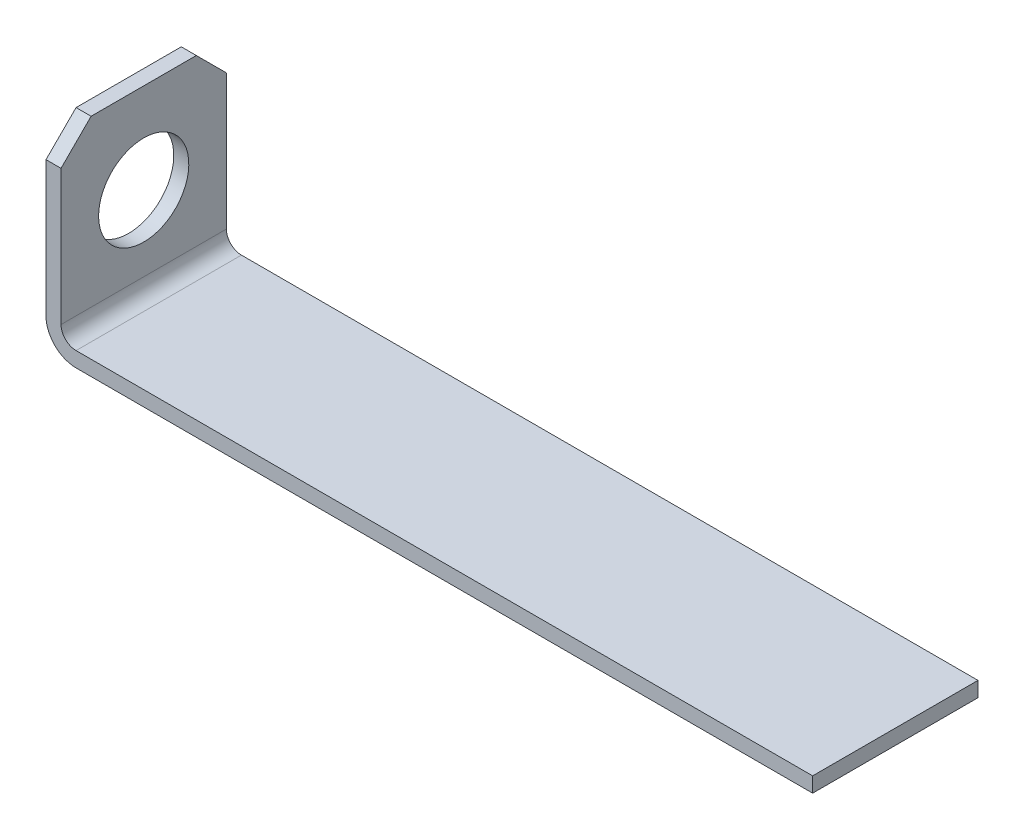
ISO-10303-21;
HEADER;
FILE_DESCRIPTION(('STEP AP214'),'2;1');
FILE_NAME('part.step','',(''),(''),'','','');
FILE_SCHEMA(('AUTOMOTIVE_DESIGN { 1 0 10303 214 1 1 1 1 }'));
ENDSEC;
DATA;
#1=APPLICATION_CONTEXT('core data for automotive mechanical design processes');
#2=APPLICATION_PROTOCOL_DEFINITION('international standard','automotive_design',2000,#1);
#3=PRODUCT_CONTEXT('',#1,'mechanical');
#4=PRODUCT('Part','Part','',(#3));
#5=PRODUCT_RELATED_PRODUCT_CATEGORY('part','',(#4));
#6=PRODUCT_DEFINITION_FORMATION('','',#4);
#7=PRODUCT_DEFINITION_CONTEXT('part definition',#1,'design');
#8=PRODUCT_DEFINITION('design','',#6,#7);
#9=PRODUCT_DEFINITION_SHAPE('','',#8);
#10=(LENGTH_UNIT() NAMED_UNIT(*) SI_UNIT(.MILLI.,.METRE.));
#11=(NAMED_UNIT(*) PLANE_ANGLE_UNIT() SI_UNIT($,.RADIAN.));
#12=(NAMED_UNIT(*) SI_UNIT($,.STERADIAN.) SOLID_ANGLE_UNIT());
#13=UNCERTAINTY_MEASURE_WITH_UNIT(LENGTH_MEASURE(1.E-05),#10,'distance_accuracy_value','');
#14=(GEOMETRIC_REPRESENTATION_CONTEXT(3) GLOBAL_UNCERTAINTY_ASSIGNED_CONTEXT((#13)) GLOBAL_UNIT_ASSIGNED_CONTEXT((#10,
#11,#12)) REPRESENTATION_CONTEXT('',''));
#15=CARTESIAN_POINT('',(0.,0.,0.));
#16=DIRECTION('',(0.,0.,1.));
#17=DIRECTION('',(1.,0.,0.));
#18=AXIS2_PLACEMENT_3D('',#15,#16,#17);
#19=CARTESIAN_POINT('',(-0.999999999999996,12.,11.));
#20=DIRECTION('',(0.,-1.,0.));
#21=DIRECTION('',(0.,0.,-1.));
#22=AXIS2_PLACEMENT_3D('',#19,#20,#21);
#23=PLANE('',#22);
#24=DIRECTION('',(0.,0.,-1.));
#25=VECTOR('',#24,1.);
#26=CARTESIAN_POINT('',(0.,12.,11.));
#27=LINE('',#26,#25);
#28=CARTESIAN_POINT('',(0.,12.,8.99999999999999));
#29=VERTEX_POINT('',#28);
#30=CARTESIAN_POINT('',(0.,12.,2.));
#31=VERTEX_POINT('',#30);
#32=EDGE_CURVE('E154',#29,#31,#27,.T.);
#33=ORIENTED_EDGE('',*,*,#32,.T.);
#34=DIRECTION('',(-1.,0.,0.));
#35=VECTOR('',#34,1.);
#36=CARTESIAN_POINT('',(-0.999999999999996,12.,2.));
#37=LINE('',#36,#35);
#38=CARTESIAN_POINT('',(-0.999999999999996,12.,2.));
#39=VERTEX_POINT('',#38);
#40=EDGE_CURVE('E186',#31,#39,#37,.T.);
#41=ORIENTED_EDGE('',*,*,#40,.T.);
#42=DIRECTION('',(0.,0.,-1.));
#43=VECTOR('',#42,1.);
#44=CARTESIAN_POINT('',(-0.999999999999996,12.,11.));
#45=LINE('',#44,#43);
#46=CARTESIAN_POINT('',(-0.999999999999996,12.,8.99999999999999));
#47=VERTEX_POINT('',#46);
#48=EDGE_CURVE('E135',#47,#39,#45,.T.);
#49=ORIENTED_EDGE('',*,*,#48,.F.);
#50=DIRECTION('',(1.,0.,0.));
#51=VECTOR('',#50,1.);
#52=CARTESIAN_POINT('',(-0.999999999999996,12.,8.99999999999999));
#53=LINE('',#52,#51);
#54=EDGE_CURVE('E184',#47,#29,#53,.T.);
#55=ORIENTED_EDGE('',*,*,#54,.T.);
#56=EDGE_LOOP('',(#33,#41,#49,#55));
#57=FACE_BOUND('',#56,.T.);
#58=ADVANCED_FACE('F38',(#57),#23,.F.);
#59=CARTESIAN_POINT('',(-0.999999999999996,12.,11.));
#60=DIRECTION('',(1.,0.,0.));
#61=DIRECTION('',(0.,1.,0.));
#62=AXIS2_PLACEMENT_3D('',#59,#60,#61);
#63=PLANE('',#62);
#64=CARTESIAN_POINT('',(-1.,6.00000000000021,5.5));
#65=DIRECTION('',(1.,0.,0.));
#66=DIRECTION('',(0.,1.,0.));
#67=AXIS2_PLACEMENT_3D('',#64,#65,#66);
#68=CIRCLE('',#67,3.);
#69=CARTESIAN_POINT('',(-1.,9.00000000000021,5.5));
#70=VERTEX_POINT('',#69);
#71=EDGE_CURVE('E157',#70,#70,#68,.T.);
#72=ORIENTED_EDGE('',*,*,#71,.T.);
#73=EDGE_LOOP('',(#72));
#74=FACE_BOUND('',#73,.T.);
#75=ORIENTED_EDGE('',*,*,#48,.T.);
#76=DIRECTION('',(0.,-0.707106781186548,-0.707106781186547));
#77=VECTOR('',#76,1.);
#78=CARTESIAN_POINT('',(-0.999999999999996,12.,2.));
#79=LINE('',#78,#77);
#80=CARTESIAN_POINT('',(-0.999999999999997,9.99999999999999,0.));
#81=VERTEX_POINT('',#80);
#82=EDGE_CURVE('E191',#39,#81,#79,.T.);
#83=ORIENTED_EDGE('',*,*,#82,.T.);
#84=DIRECTION('',(0.,-1.,0.));
#85=VECTOR('',#84,1.);
#86=CARTESIAN_POINT('',(-0.999999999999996,12.,0.));
#87=LINE('',#86,#85);
#88=CARTESIAN_POINT('',(-1.,1.,0.));
#89=VERTEX_POINT('',#88);
#90=EDGE_CURVE('E132',#81,#89,#87,.T.);
#91=ORIENTED_EDGE('',*,*,#90,.T.);
#92=DIRECTION('',(0.,0.,-1.));
#93=VECTOR('',#92,1.);
#94=CARTESIAN_POINT('',(-1.,1.,11.));
#95=LINE('',#94,#93);
#96=CARTESIAN_POINT('',(-1.,1.,11.));
#97=VERTEX_POINT('',#96);
#98=EDGE_CURVE('E129',#97,#89,#95,.T.);
#99=ORIENTED_EDGE('',*,*,#98,.F.);
#100=DIRECTION('',(0.,-1.,0.));
#101=VECTOR('',#100,1.);
#102=CARTESIAN_POINT('',(-0.999999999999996,12.,11.));
#103=LINE('',#102,#101);
#104=CARTESIAN_POINT('',(-0.999999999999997,10.,11.));
#105=VERTEX_POINT('',#104);
#106=EDGE_CURVE('E118',#105,#97,#103,.T.);
#107=ORIENTED_EDGE('',*,*,#106,.F.);
#108=DIRECTION('',(0.,-0.707106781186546,0.707106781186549));
#109=VECTOR('',#108,1.);
#110=CARTESIAN_POINT('',(-0.999999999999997,10.,11.));
#111=LINE('',#110,#109);
#112=EDGE_CURVE('E189',#105,#47,#111,.F.);
#113=ORIENTED_EDGE('',*,*,#112,.T.);
#114=EDGE_LOOP('',(#75,#83,#91,#99,#107,#113));
#115=FACE_BOUND('',#114,.T.);
#116=ADVANCED_FACE('F131',(#74,#115),#63,.F.);
#117=CARTESIAN_POINT('',(1.,0.999999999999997,11.));
#118=DIRECTION('',(0.,0.,-1.));
#119=DIRECTION('',(-1.,0.,0.));
#120=AXIS2_PLACEMENT_3D('',#117,#118,#119);
#121=CYLINDRICAL_SURFACE('',#120,2.);
#122=CARTESIAN_POINT('',(1.,0.999999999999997,0.));
#123=DIRECTION('',(0.,0.,1.));
#124=DIRECTION('',(-1.,0.,0.));
#125=AXIS2_PLACEMENT_3D('',#122,#123,#124);
#126=CIRCLE('',#125,2.);
#127=CARTESIAN_POINT('',(1.00000000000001,-1.,0.));
#128=VERTEX_POINT('',#127);
#129=EDGE_CURVE('E156',#89,#128,#126,.T.);
#130=ORIENTED_EDGE('',*,*,#129,.T.);
#131=DIRECTION('',(0.,0.,-1.));
#132=VECTOR('',#131,1.);
#133=CARTESIAN_POINT('',(1.00000000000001,-1.,11.));
#134=LINE('',#133,#132);
#135=CARTESIAN_POINT('',(1.00000000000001,-1.,11.));
#136=VERTEX_POINT('',#135);
#137=EDGE_CURVE('E136',#136,#128,#134,.T.);
#138=ORIENTED_EDGE('',*,*,#137,.F.);
#139=CARTESIAN_POINT('',(1.,0.999999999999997,11.));
#140=DIRECTION('',(0.,0.,1.));
#141=DIRECTION('',(-1.,0.,0.));
#142=AXIS2_PLACEMENT_3D('',#139,#140,#141);
#143=CIRCLE('',#142,2.);
#144=EDGE_CURVE('E122',#97,#136,#143,.T.);
#145=ORIENTED_EDGE('',*,*,#144,.F.);
#146=ORIENTED_EDGE('',*,*,#98,.T.);
#147=EDGE_LOOP('',(#130,#138,#145,#146));
#148=FACE_BOUND('',#147,.T.);
#149=ADVANCED_FACE('F138',(#148),#121,.T.);
#150=CARTESIAN_POINT('',(1.00000000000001,-1.,11.));
#151=DIRECTION('',(0.,1.,0.));
#152=DIRECTION('',(-1.,0.,0.));
#153=AXIS2_PLACEMENT_3D('',#150,#151,#152);
#154=PLANE('',#153);
#155=DIRECTION('',(1.,0.,0.));
#156=VECTOR('',#155,1.);
#157=CARTESIAN_POINT('',(1.00000000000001,-1.,0.));
#158=LINE('',#157,#156);
#159=CARTESIAN_POINT('',(50.,-0.999999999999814,0.));
#160=VERTEX_POINT('',#159);
#161=EDGE_CURVE('E159',#128,#160,#158,.T.);
#162=ORIENTED_EDGE('',*,*,#161,.T.);
#163=DIRECTION('',(0.,0.,-1.));
#164=VECTOR('',#163,1.);
#165=CARTESIAN_POINT('',(50.,-0.999999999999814,11.));
#166=LINE('',#165,#164);
#167=CARTESIAN_POINT('',(50.,-0.999999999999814,11.));
#168=VERTEX_POINT('',#167);
#169=EDGE_CURVE('E179',#168,#160,#166,.T.);
#170=ORIENTED_EDGE('',*,*,#169,.F.);
#171=DIRECTION('',(1.,0.,0.));
#172=VECTOR('',#171,1.);
#173=CARTESIAN_POINT('',(1.00000000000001,-1.,11.));
#174=LINE('',#173,#172);
#175=EDGE_CURVE('E141',#136,#168,#174,.T.);
#176=ORIENTED_EDGE('',*,*,#175,.F.);
#177=ORIENTED_EDGE('',*,*,#137,.T.);
#178=EDGE_LOOP('',(#162,#170,#176,#177));
#179=FACE_BOUND('',#178,.T.);
#180=ADVANCED_FACE('F206',(#179),#154,.F.);
#181=CARTESIAN_POINT('',(50.,1.85615446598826E-13,11.));
#182=DIRECTION('',(-1.,0.,0.));
#183=DIRECTION('',(0.,-1.,0.));
#184=AXIS2_PLACEMENT_3D('',#181,#182,#183);
#185=PLANE('',#184);
#186=DIRECTION('',(0.,1.,0.));
#187=VECTOR('',#186,1.);
#188=CARTESIAN_POINT('',(50.,1.85615446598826E-13,0.));
#189=LINE('',#188,#187);
#190=CARTESIAN_POINT('',(50.,1.85615446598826E-13,0.));
#191=VERTEX_POINT('',#190);
#192=EDGE_CURVE('E161',#160,#191,#189,.T.);
#193=ORIENTED_EDGE('',*,*,#192,.T.);
#194=DIRECTION('',(0.,0.,-1.));
#195=VECTOR('',#194,1.);
#196=CARTESIAN_POINT('',(50.,1.85615446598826E-13,11.));
#197=LINE('',#196,#195);
#198=CARTESIAN_POINT('',(50.,1.85615446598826E-13,11.));
#199=VERTEX_POINT('',#198);
#200=EDGE_CURVE('E176',#199,#191,#197,.T.);
#201=ORIENTED_EDGE('',*,*,#200,.F.);
#202=DIRECTION('',(0.,1.,0.));
#203=VECTOR('',#202,1.);
#204=CARTESIAN_POINT('',(50.,1.85615446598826E-13,11.));
#205=LINE('',#204,#203);
#206=EDGE_CURVE('E143',#168,#199,#205,.T.);
#207=ORIENTED_EDGE('',*,*,#206,.F.);
#208=ORIENTED_EDGE('',*,*,#169,.T.);
#209=EDGE_LOOP('',(#193,#201,#207,#208));
#210=FACE_BOUND('',#209,.T.);
#211=ADVANCED_FACE('F213',(#210),#185,.F.);
#212=CARTESIAN_POINT('',(1.00000000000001,0.,11.));
#213=DIRECTION('',(0.,-1.,0.));
#214=DIRECTION('',(1.,0.,0.));
#215=AXIS2_PLACEMENT_3D('',#212,#213,#214);
#216=PLANE('',#215);
#217=DIRECTION('',(-1.,0.,0.));
#218=VECTOR('',#217,1.);
#219=CARTESIAN_POINT('',(1.00000000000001,0.,0.));
#220=LINE('',#219,#218);
#221=CARTESIAN_POINT('',(1.00000000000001,0.,0.));
#222=VERTEX_POINT('',#221);
#223=EDGE_CURVE('E163',#191,#222,#220,.T.);
#224=ORIENTED_EDGE('',*,*,#223,.T.);
#225=DIRECTION('',(0.,0.,-1.));
#226=VECTOR('',#225,1.);
#227=CARTESIAN_POINT('',(1.00000000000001,0.,11.));
#228=LINE('',#227,#226);
#229=CARTESIAN_POINT('',(1.00000000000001,0.,11.));
#230=VERTEX_POINT('',#229);
#231=EDGE_CURVE('E173',#230,#222,#228,.T.);
#232=ORIENTED_EDGE('',*,*,#231,.F.);
#233=DIRECTION('',(-1.,0.,0.));
#234=VECTOR('',#233,1.);
#235=CARTESIAN_POINT('',(1.00000000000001,0.,11.));
#236=LINE('',#235,#234);
#237=EDGE_CURVE('E148',#199,#230,#236,.T.);
#238=ORIENTED_EDGE('',*,*,#237,.F.);
#239=ORIENTED_EDGE('',*,*,#200,.T.);
#240=EDGE_LOOP('',(#224,#232,#238,#239));
#241=FACE_BOUND('',#240,.T.);
#242=ADVANCED_FACE('F216',(#241),#216,.F.);
#243=CARTESIAN_POINT('',(1.,0.999999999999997,11.));
#244=DIRECTION('',(0.,0.,-1.));
#245=DIRECTION('',(-1.,0.,0.));
#246=AXIS2_PLACEMENT_3D('',#243,#244,#245);
#247=CYLINDRICAL_SURFACE('',#246,1.);
#248=CARTESIAN_POINT('',(1.,0.999999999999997,0.));
#249=DIRECTION('',(0.,0.,-1.));
#250=DIRECTION('',(-1.,0.,0.));
#251=AXIS2_PLACEMENT_3D('',#248,#249,#250);
#252=CIRCLE('',#251,1.);
#253=CARTESIAN_POINT('',(0.,1.,0.));
#254=VERTEX_POINT('',#253);
#255=EDGE_CURVE('E165',#222,#254,#252,.T.);
#256=ORIENTED_EDGE('',*,*,#255,.T.);
#257=DIRECTION('',(0.,0.,-1.));
#258=VECTOR('',#257,1.);
#259=CARTESIAN_POINT('',(0.,1.,11.));
#260=LINE('',#259,#258);
#261=CARTESIAN_POINT('',(0.,1.,11.));
#262=VERTEX_POINT('',#261);
#263=EDGE_CURVE('E170',#262,#254,#260,.T.);
#264=ORIENTED_EDGE('',*,*,#263,.F.);
#265=CARTESIAN_POINT('',(1.,0.999999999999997,11.));
#266=DIRECTION('',(0.,0.,-1.));
#267=DIRECTION('',(-1.,0.,0.));
#268=AXIS2_PLACEMENT_3D('',#265,#266,#267);
#269=CIRCLE('',#268,1.);
#270=EDGE_CURVE('E150',#230,#262,#269,.T.);
#271=ORIENTED_EDGE('',*,*,#270,.F.);
#272=ORIENTED_EDGE('',*,*,#231,.T.);
#273=EDGE_LOOP('',(#256,#264,#271,#272));
#274=FACE_BOUND('',#273,.T.);
#275=ADVANCED_FACE('F221',(#274),#247,.F.);
#276=CARTESIAN_POINT('',(0.,12.,11.));
#277=DIRECTION('',(-1.,0.,0.));
#278=DIRECTION('',(0.,-1.,0.));
#279=AXIS2_PLACEMENT_3D('',#276,#277,#278);
#280=PLANE('',#279);
#281=CARTESIAN_POINT('',(0.,6.00000000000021,5.5));
#282=DIRECTION('',(1.,0.,0.));
#283=DIRECTION('',(0.,1.,0.));
#284=AXIS2_PLACEMENT_3D('',#281,#282,#283);
#285=CIRCLE('',#284,3.);
#286=CARTESIAN_POINT('',(0.,9.00000000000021,5.5));
#287=VERTEX_POINT('',#286);
#288=EDGE_CURVE('E262',#287,#287,#285,.T.);
#289=ORIENTED_EDGE('',*,*,#288,.F.);
#290=EDGE_LOOP('',(#289));
#291=FACE_BOUND('',#290,.T.);
#292=DIRECTION('',(0.,1.,0.));
#293=VECTOR('',#292,1.);
#294=CARTESIAN_POINT('',(0.,12.,0.));
#295=LINE('',#294,#293);
#296=CARTESIAN_POINT('',(0.,9.99999999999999,0.));
#297=VERTEX_POINT('',#296);
#298=EDGE_CURVE('E126',#254,#297,#295,.T.);
#299=ORIENTED_EDGE('',*,*,#298,.T.);
#300=DIRECTION('',(0.,0.707106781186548,0.707106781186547));
#301=VECTOR('',#300,1.);
#302=CARTESIAN_POINT('',(0.,12.,2.));
#303=LINE('',#302,#301);
#304=EDGE_CURVE('E46',#297,#31,#303,.T.);
#305=ORIENTED_EDGE('',*,*,#304,.T.);
#306=ORIENTED_EDGE('',*,*,#32,.F.);
#307=DIRECTION('',(0.,0.707106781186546,-0.707106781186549));
#308=VECTOR('',#307,1.);
#309=CARTESIAN_POINT('',(0.,10.,11.));
#310=LINE('',#309,#308);
#311=CARTESIAN_POINT('',(0.,10.,11.));
#312=VERTEX_POINT('',#311);
#313=EDGE_CURVE('E53',#29,#312,#310,.F.);
#314=ORIENTED_EDGE('',*,*,#313,.T.);
#315=DIRECTION('',(0.,1.,0.));
#316=VECTOR('',#315,1.);
#317=CARTESIAN_POINT('',(0.,12.,11.));
#318=LINE('',#317,#316);
#319=EDGE_CURVE('E152',#262,#312,#318,.T.);
#320=ORIENTED_EDGE('',*,*,#319,.F.);
#321=ORIENTED_EDGE('',*,*,#263,.T.);
#322=EDGE_LOOP('',(#299,#305,#306,#314,#320,#321));
#323=FACE_BOUND('',#322,.T.);
#324=ADVANCED_FACE('F195',(#291,#323),#280,.F.);
#325=CARTESIAN_POINT('',(1.,0.999999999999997,11.));
#326=DIRECTION('',(0.,0.,-1.));
#327=DIRECTION('',(-1.,0.,0.));
#328=AXIS2_PLACEMENT_3D('',#325,#326,#327);
#329=PLANE('',#328);
#330=ORIENTED_EDGE('',*,*,#319,.T.);
#331=DIRECTION('',(-1.,0.,0.));
#332=VECTOR('',#331,1.);
#333=CARTESIAN_POINT('',(1.,10.,11.));
#334=LINE('',#333,#332);
#335=EDGE_CURVE('E11',#312,#105,#334,.T.);
#336=ORIENTED_EDGE('',*,*,#335,.T.);
#337=ORIENTED_EDGE('',*,*,#106,.T.);
#338=ORIENTED_EDGE('',*,*,#144,.T.);
#339=ORIENTED_EDGE('',*,*,#175,.T.);
#340=ORIENTED_EDGE('',*,*,#206,.T.);
#341=ORIENTED_EDGE('',*,*,#237,.T.);
#342=ORIENTED_EDGE('',*,*,#270,.T.);
#343=EDGE_LOOP('',(#330,#336,#337,#338,#339,#340,#341,#342));
#344=FACE_BOUND('',#343,.T.);
#345=ADVANCED_FACE('F120',(#344),#329,.F.);
#346=CARTESIAN_POINT('',(1.,0.999999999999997,0.));
#347=DIRECTION('',(0.,0.,-1.));
#348=DIRECTION('',(-1.,0.,0.));
#349=AXIS2_PLACEMENT_3D('',#346,#347,#348);
#350=PLANE('',#349);
#351=ORIENTED_EDGE('',*,*,#90,.F.);
#352=DIRECTION('',(1.,0.,0.));
#353=VECTOR('',#352,1.);
#354=CARTESIAN_POINT('',(0.,9.99999999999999,0.));
#355=LINE('',#354,#353);
#356=EDGE_CURVE('E61',#81,#297,#355,.T.);
#357=ORIENTED_EDGE('',*,*,#356,.T.);
#358=ORIENTED_EDGE('',*,*,#298,.F.);
#359=ORIENTED_EDGE('',*,*,#255,.F.);
#360=ORIENTED_EDGE('',*,*,#223,.F.);
#361=ORIENTED_EDGE('',*,*,#192,.F.);
#362=ORIENTED_EDGE('',*,*,#161,.F.);
#363=ORIENTED_EDGE('',*,*,#129,.F.);
#364=EDGE_LOOP('',(#351,#357,#358,#359,#360,#361,#362,#363));
#365=FACE_BOUND('',#364,.T.);
#366=ADVANCED_FACE('F202',(#365),#350,.T.);
#367=CARTESIAN_POINT('',(-1.,6.00000000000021,5.5));
#368=DIRECTION('',(1.,0.,0.));
#369=DIRECTION('',(0.,1.,0.));
#370=AXIS2_PLACEMENT_3D('',#367,#368,#369);
#371=CYLINDRICAL_SURFACE('',#370,3.);
#372=ORIENTED_EDGE('',*,*,#71,.F.);
#373=EDGE_LOOP('',(#372));
#374=FACE_BOUND('',#373,.T.);
#375=ORIENTED_EDGE('',*,*,#288,.T.);
#376=EDGE_LOOP('',(#375));
#377=FACE_BOUND('',#376,.T.);
#378=ADVANCED_FACE('F227',(#374,#377),#371,.F.);
#379=CARTESIAN_POINT('',(-0.999999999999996,12.,2.));
#380=DIRECTION('',(0.,0.707106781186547,-0.707106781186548));
#381=DIRECTION('',(0.,0.707106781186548,0.707106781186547));
#382=AXIS2_PLACEMENT_3D('',#379,#380,#381);
#383=PLANE('',#382);
#384=ORIENTED_EDGE('',*,*,#304,.F.);
#385=ORIENTED_EDGE('',*,*,#356,.F.);
#386=ORIENTED_EDGE('',*,*,#82,.F.);
#387=ORIENTED_EDGE('',*,*,#40,.F.);
#388=EDGE_LOOP('',(#384,#385,#386,#387));
#389=FACE_BOUND('',#388,.T.);
#390=ADVANCED_FACE('F201',(#389),#383,.T.);
#391=CARTESIAN_POINT('',(1.,10.,11.));
#392=DIRECTION('',(0.,-0.707106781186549,-0.707106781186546));
#393=DIRECTION('',(0.,0.707106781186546,-0.707106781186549));
#394=AXIS2_PLACEMENT_3D('',#391,#392,#393);
#395=PLANE('',#394);
#396=ORIENTED_EDGE('',*,*,#313,.F.);
#397=ORIENTED_EDGE('',*,*,#54,.F.);
#398=ORIENTED_EDGE('',*,*,#112,.F.);
#399=ORIENTED_EDGE('',*,*,#335,.F.);
#400=EDGE_LOOP('',(#396,#397,#398,#399));
#401=FACE_BOUND('',#400,.T.);
#402=ADVANCED_FACE('F40',(#401),#395,.F.);
#403=CLOSED_SHELL('',(#58,#116,#149,#180,#211,#242,#275,#324,#345,#366,#378,#390,#402));
#404=MANIFOLD_SOLID_BREP('B2',#403);
#405=ADVANCED_BREP_SHAPE_REPRESENTATION('',(#18,#404),#14);
#406=SHAPE_DEFINITION_REPRESENTATION(#9,#405);
ENDSEC;
END-ISO-10303-21;
